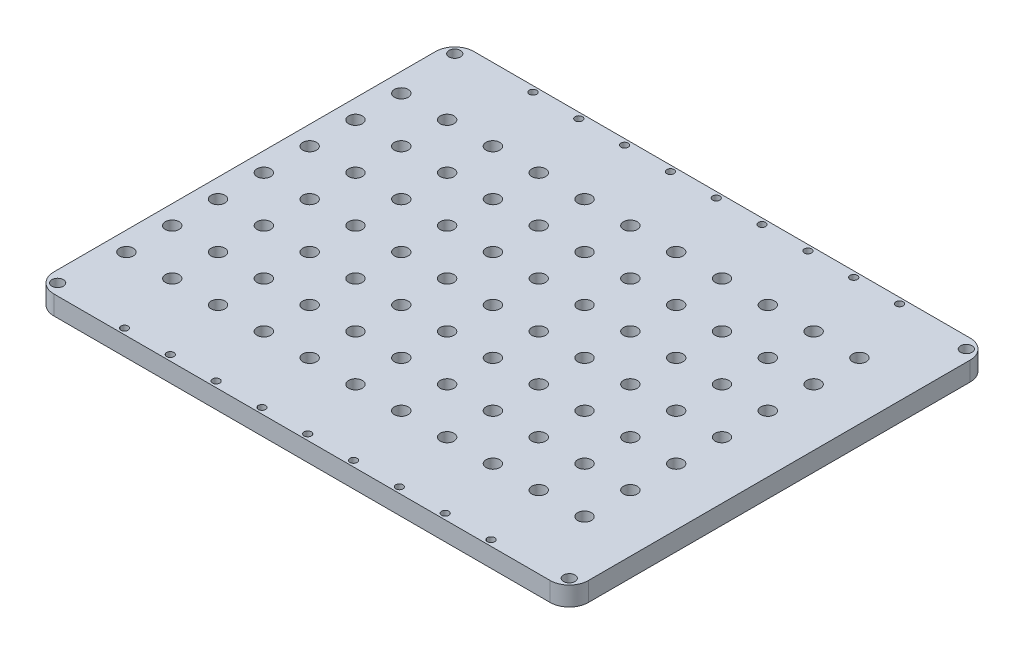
from build123d import *

# Parameters (mm, degrees)
SKETCH1_W           = 140
SKETCH1_H           = 110
BOSS_EXTRUDE1_DEPTH = 5
FILLET1_R           = 5
SKETCH2_R           = 1.5
CUT_EXTRUDE1_DEPTH  = 5
SKETCH3_R           = 0.95
CUT_EXTRUDE2_DEPTH  = 5
SKETCH4_R           = 1.8
CUT_EXTRUDE5_DEPTH  = 5
LPATTERN2_COUNT     = 11
LPATTERN2_PITCH     = 12


with BuildPart() as part:
    # Sketch1 → Boss-Extrude1 (new body)
    with BuildSketch(Plane(origin=(0, 0, 0), x_dir=(1, 0, 0), z_dir=(0, 1, 0))):
        Rectangle(SKETCH1_W, SKETCH1_H)
    extrude(amount=BOSS_EXTRUDE1_DEPTH)

    # Fillet1
    fillet1_edges = [part.edges().sort_by_distance(p)[0] for p in [
        (70, 2.5, 55),
        (-70, 2.5, 55),
        (-70, 2.5, -55),
        (70, 2.5, -55),
    ]]
    fillet(fillet1_edges, radius=FILLET1_R)

    # Sketch2 → Cut-Extrude1 (cut)
    with BuildSketch(Plane(origin=(0, 5, 0), x_dir=(1, 0, 0), z_dir=(0, 1, 0))):
        with Locations(Location((-67.001112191, 52.001112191, 0), (0, 0, 270))):
            Circle(SKETCH2_R)
        with Locations(Location((66.998887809, 52.001112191, 0), (0, 0, 270))):
            Circle(SKETCH2_R)
        with Locations(Location((66.998887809, -51.998887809, 0), (0, 0, 270))):
            Circle(SKETCH2_R)
        with Locations(Location((-67.001112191, -51.998887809, 0), (0, 0, 270))):
            Circle(SKETCH2_R)
    extrude(amount=-CUT_EXTRUDE1_DEPTH, mode=Mode.SUBTRACT)

    # Sketch3 → Cut-Extrude2 (cut)
    with BuildSketch(Plane(origin=(0, 5, 0), x_dir=(1, 0, 0), z_dir=(0, 1, 0))):
        with Locations(Location((-48, -53.5, 0), (0, 0, 270))):
            Circle(SKETCH3_R)
        with Locations(Location((-36, -53.5, 0), (0, 0, 270))):
            Circle(SKETCH3_R)
        with Locations(Location((-24, -53.5, 0), (0, 0, 270))):
            Circle(SKETCH3_R)
        with Locations(Location((-12, -53.5, 0), (0, 0, 270))):
            Circle(SKETCH3_R)
        with Locations(Location((0, -53.5, 0), (0, 0, 270))):
            Circle(SKETCH3_R)
        with Locations(Location((12, -53.5, 0), (0, 0, 270))):
            Circle(SKETCH3_R)
        with Locations(Location((24, -53.5, 0), (0, 0, 270))):
            Circle(SKETCH3_R)
        with Locations(Location((48, -53.5, 0), (0, 0, 270))):
            Circle(SKETCH3_R)
        with Locations(Location((36, -53.5, 0), (0, 0, 270))):
            Circle(SKETCH3_R)
    cut_extrude2 = extrude(amount=-CUT_EXTRUDE2_DEPTH, mode=Mode.SUBTRACT)

    # Mirror1: Cut-Extrude2 across plane
    add(cut_extrude2.mirror(Plane.XY), mode=Mode.SUBTRACT)

    # Sketch4 → Cut-Extrude5 (cut)
    with BuildSketch(Plane(origin=(0, 5, 0), x_dir=(1, 0, 0), z_dir=(0, 1, 0))):
        with Locations(Location((-65, 0, 0), (0, 0, 270))):
            Circle(SKETCH4_R)
        with Locations(Location((-65, 12, 0), (0, 0, 270))):
            Circle(SKETCH4_R)
        with Locations(Location((-65, 24, 0), (0, 0, 270))):
            Circle(SKETCH4_R)
        with Locations(Location((-65, 36, 0), (0, 0, 270))):
            Circle(SKETCH4_R)
        with Locations(Location((-65, -12, 0), (0, 0, 270))):
            Circle(SKETCH4_R)
        with Locations(Location((-65, -24, 0), (0, 0, 270))):
            Circle(SKETCH4_R)
        with Locations(Location((-65, -36, 0), (0, 0, 270))):
            Circle(SKETCH4_R)
    cut_extrude5 = extrude(amount=-CUT_EXTRUDE5_DEPTH, mode=Mode.SUBTRACT)

    # LPattern2: Cut-Extrude5 ×11
    with Locations(*[(i * LPATTERN2_PITCH, 0, 0) for i in range(1, LPATTERN2_COUNT)]):
        add(cut_extrude5, mode=Mode.SUBTRACT)


solid = part.part
